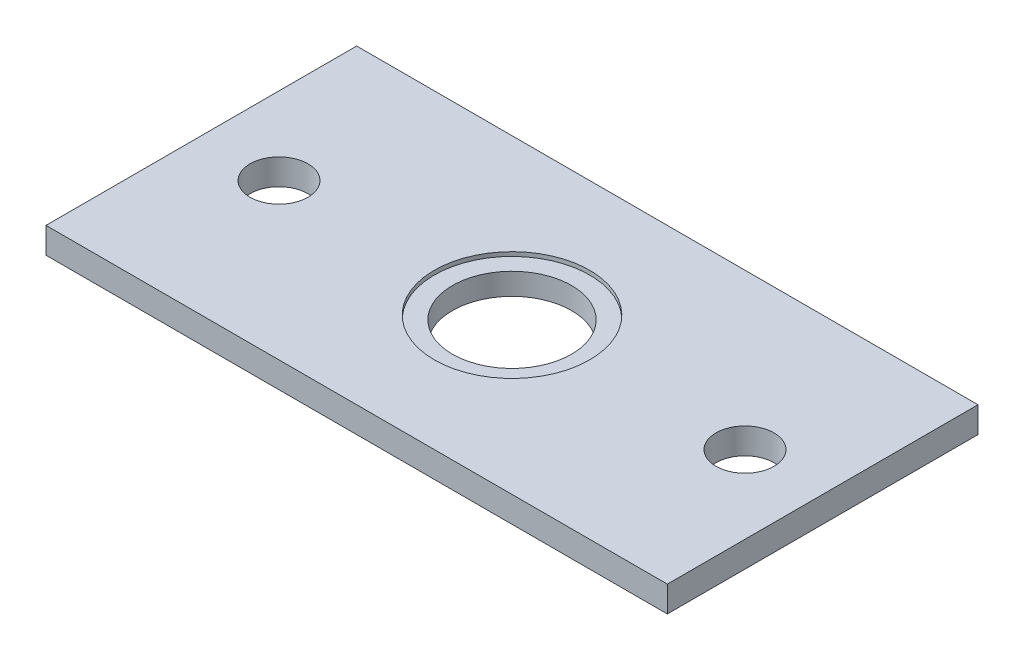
from build123d import *

# Parameters (mm, degrees)
SKETCH1_W          = 76.2
SKETCH1_H          = 38.1
EXTRUDE1_DEPTH     = 3.175
SKETCH2_R          = 7.3025
SKETCH2_R_2        = 3.556
CUT_EXTRUDE1_DEPTH = 86.253332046
SKETCH3_R          = 9.525
CUT_EXTRUDE2_DEPTH = 0.508


with BuildPart() as part:
    # Sketch1 → Extrude1 (new body)
    with BuildSketch(Plane(origin=(0, 0, 0), x_dir=(1, 0, 0), z_dir=(0, 1, 0))):
        with Locations((38.1, 19.05)):
            Rectangle(SKETCH1_W, SKETCH1_H)
    extrude(amount=EXTRUDE1_DEPTH)

    # Sketch2 → Cut-Extrude1 (cut, through all)
    with BuildSketch(Plane(origin=(0, 3.175, 0), x_dir=(-1, 0, 0), z_dir=(0, 1, 0))):
        with Locations(Location((-38.1, -19.05, 0), (0, 0, 90))):
            Circle(SKETCH2_R)
        with Locations(Location((-66.675, -19.05, 0), (0, 0, 90))):
            Circle(SKETCH2_R_2)
        with Locations(Location((-9.525, -19.05, 0), (0, 0, 270))):
            Circle(SKETCH2_R_2)
    extrude(amount=-CUT_EXTRUDE1_DEPTH, mode=Mode.SUBTRACT)

    # Sketch3 → Cut-Extrude2 (cut)
    with BuildSketch(Plane(origin=(0, 3.175, 0), x_dir=(1, 0, 0), z_dir=(0, 1, 0))):
        with Locations(Location((38.1, 19.05, 0), (0, 0, 270))):
            Circle(SKETCH3_R)
    extrude(amount=-CUT_EXTRUDE2_DEPTH, mode=Mode.SUBTRACT)


solid = part.part
